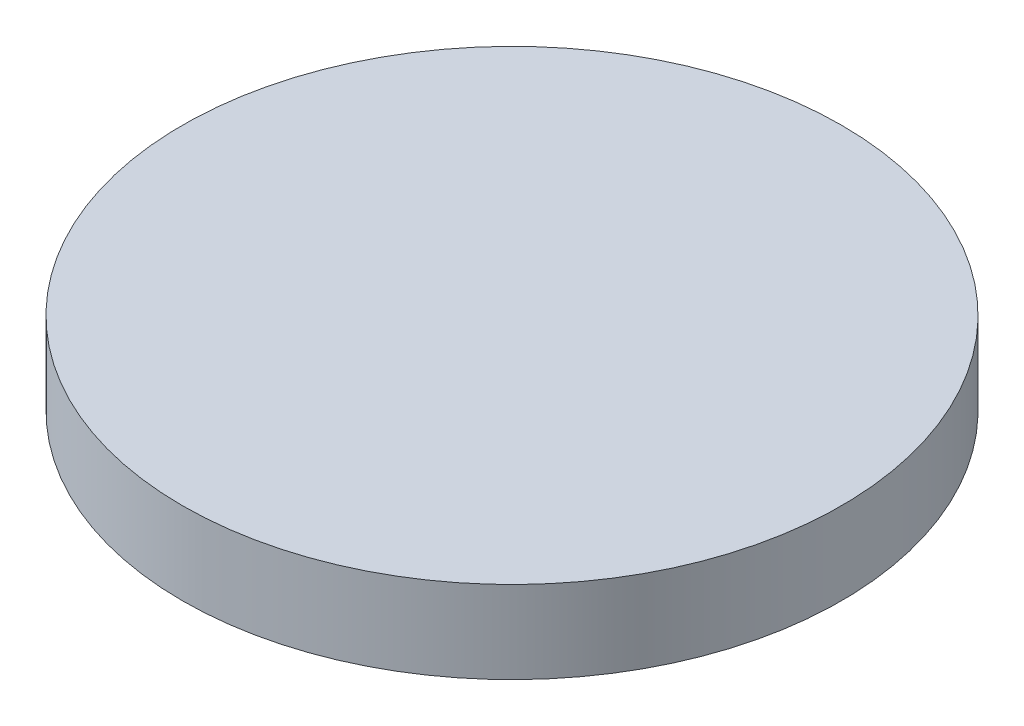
ISO-10303-21;
HEADER;
FILE_DESCRIPTION(('STEP AP214'),'2;1');
FILE_NAME('part.step','',(''),(''),'','','');
FILE_SCHEMA(('AUTOMOTIVE_DESIGN { 1 0 10303 214 1 1 1 1 }'));
ENDSEC;
DATA;
#1=APPLICATION_CONTEXT('core data for automotive mechanical design processes');
#2=APPLICATION_PROTOCOL_DEFINITION('international standard','automotive_design',2000,#1);
#3=PRODUCT_CONTEXT('',#1,'mechanical');
#4=PRODUCT('Part','Part','',(#3));
#5=PRODUCT_RELATED_PRODUCT_CATEGORY('part','',(#4));
#6=PRODUCT_DEFINITION_FORMATION('','',#4);
#7=PRODUCT_DEFINITION_CONTEXT('part definition',#1,'design');
#8=PRODUCT_DEFINITION('design','',#6,#7);
#9=PRODUCT_DEFINITION_SHAPE('','',#8);
#10=(LENGTH_UNIT() NAMED_UNIT(*) SI_UNIT(.MILLI.,.METRE.));
#11=(NAMED_UNIT(*) PLANE_ANGLE_UNIT() SI_UNIT($,.RADIAN.));
#12=(NAMED_UNIT(*) SI_UNIT($,.STERADIAN.) SOLID_ANGLE_UNIT());
#13=UNCERTAINTY_MEASURE_WITH_UNIT(LENGTH_MEASURE(1.E-05),#10,'distance_accuracy_value','');
#14=(GEOMETRIC_REPRESENTATION_CONTEXT(3) GLOBAL_UNCERTAINTY_ASSIGNED_CONTEXT((#13)) GLOBAL_UNIT_ASSIGNED_CONTEXT((#10,
#11,#12)) REPRESENTATION_CONTEXT('',''));
#15=CARTESIAN_POINT('',(0.,0.,0.));
#16=DIRECTION('',(0.,0.,1.));
#17=DIRECTION('',(1.,0.,0.));
#18=AXIS2_PLACEMENT_3D('',#15,#16,#17);
#19=CARTESIAN_POINT('',(0.,0.79375,0.));
#20=DIRECTION('',(0.,-1.,0.));
#21=DIRECTION('',(0.,0.,-1.));
#22=AXIS2_PLACEMENT_3D('',#19,#20,#21);
#23=CYLINDRICAL_SURFACE('',#22,6.35);
#24=CARTESIAN_POINT('',(0.,0.79375,0.));
#25=DIRECTION('',(0.,1.,0.));
#26=DIRECTION('',(0.,0.,1.));
#27=AXIS2_PLACEMENT_3D('',#24,#25,#26);
#28=CIRCLE('',#27,6.35);
#29=CARTESIAN_POINT('',(0.,0.79375,6.35));
#30=VERTEX_POINT('',#29);
#31=EDGE_CURVE('E10',#30,#30,#28,.T.);
#32=ORIENTED_EDGE('',*,*,#31,.F.);
#33=EDGE_LOOP('',(#32));
#34=FACE_BOUND('',#33,.T.);
#35=CARTESIAN_POINT('',(0.,-0.79375,0.));
#36=DIRECTION('',(0.,1.,0.));
#37=DIRECTION('',(0.,0.,1.));
#38=AXIS2_PLACEMENT_3D('',#35,#36,#37);
#39=CIRCLE('',#38,6.35);
#40=CARTESIAN_POINT('',(0.,-0.79375,6.35));
#41=VERTEX_POINT('',#40);
#42=EDGE_CURVE('E42',#41,#41,#39,.T.);
#43=ORIENTED_EDGE('',*,*,#42,.T.);
#44=EDGE_LOOP('',(#43));
#45=FACE_BOUND('',#44,.T.);
#46=ADVANCED_FACE('F36',(#34,#45),#23,.T.);
#47=CARTESIAN_POINT('',(0.,0.79375,0.));
#48=DIRECTION('',(0.,1.,0.));
#49=DIRECTION('',(0.,0.,1.));
#50=AXIS2_PLACEMENT_3D('',#47,#48,#49);
#51=PLANE('',#50);
#52=ORIENTED_EDGE('',*,*,#31,.T.);
#53=EDGE_LOOP('',(#52));
#54=FACE_BOUND('',#53,.T.);
#55=ADVANCED_FACE('F51',(#54),#51,.T.);
#56=CARTESIAN_POINT('',(0.,-0.79375,0.));
#57=DIRECTION('',(0.,1.,0.));
#58=DIRECTION('',(0.,0.,1.));
#59=AXIS2_PLACEMENT_3D('',#56,#57,#58);
#60=PLANE('',#59);
#61=ORIENTED_EDGE('',*,*,#42,.F.);
#62=EDGE_LOOP('',(#61));
#63=FACE_BOUND('',#62,.T.);
#64=ADVANCED_FACE('F49',(#63),#60,.F.);
#65=CLOSED_SHELL('',(#46,#55,#64));
#66=MANIFOLD_SOLID_BREP('B2',#65);
#67=ADVANCED_BREP_SHAPE_REPRESENTATION('',(#18,#66),#14);
#68=SHAPE_DEFINITION_REPRESENTATION(#9,#67);
ENDSEC;
END-ISO-10303-21;
